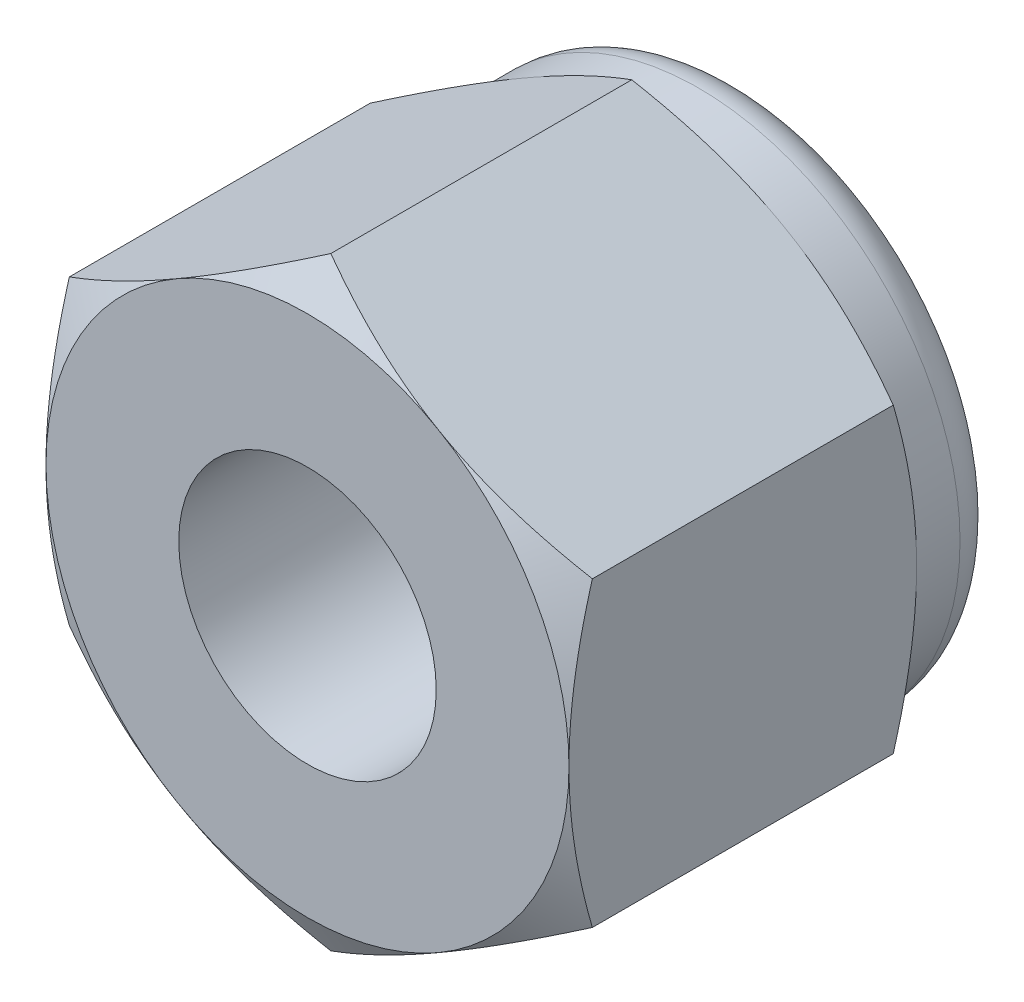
ISO-10303-21;
HEADER;
FILE_DESCRIPTION(('STEP AP214'),'2;1');
FILE_NAME('part.step','',(''),(''),'','','');
FILE_SCHEMA(('AUTOMOTIVE_DESIGN { 1 0 10303 214 1 1 1 1 }'));
ENDSEC;
DATA;
#1=APPLICATION_CONTEXT('core data for automotive mechanical design processes');
#2=APPLICATION_PROTOCOL_DEFINITION('international standard','automotive_design',2000,#1);
#3=PRODUCT_CONTEXT('',#1,'mechanical');
#4=PRODUCT('Part','Part','',(#3));
#5=PRODUCT_RELATED_PRODUCT_CATEGORY('part','',(#4));
#6=PRODUCT_DEFINITION_FORMATION('','',#4);
#7=PRODUCT_DEFINITION_CONTEXT('part definition',#1,'design');
#8=PRODUCT_DEFINITION('design','',#6,#7);
#9=PRODUCT_DEFINITION_SHAPE('','',#8);
#10=(LENGTH_UNIT() NAMED_UNIT(*) SI_UNIT(.MILLI.,.METRE.));
#11=(NAMED_UNIT(*) PLANE_ANGLE_UNIT() SI_UNIT($,.RADIAN.));
#12=(NAMED_UNIT(*) SI_UNIT($,.STERADIAN.) SOLID_ANGLE_UNIT());
#13=UNCERTAINTY_MEASURE_WITH_UNIT(LENGTH_MEASURE(1.E-05),#10,'distance_accuracy_value','');
#14=(GEOMETRIC_REPRESENTATION_CONTEXT(3) GLOBAL_UNCERTAINTY_ASSIGNED_CONTEXT((#13)) GLOBAL_UNIT_ASSIGNED_CONTEXT((#10,
#11,#12)) REPRESENTATION_CONTEXT('',''));
#15=CARTESIAN_POINT('',(0.,0.,0.));
#16=DIRECTION('',(0.,0.,1.));
#17=DIRECTION('',(1.,0.,0.));
#18=AXIS2_PLACEMENT_3D('',#15,#16,#17);
#19=CARTESIAN_POINT('',(-6.5,11.2583302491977,0.));
#20=DIRECTION('',(0.,0.,-1.));
#21=DIRECTION('',(-1.,0.,0.));
#22=AXIS2_PLACEMENT_3D('',#19,#20,#21);
#23=PLANE('',#22);
#24=CARTESIAN_POINT('',(0.,0.,0.));
#25=DIRECTION('',(0.,0.,-1.));
#26=DIRECTION('',(-1.,0.,0.));
#27=AXIS2_PLACEMENT_3D('',#24,#25,#26);
#28=CIRCLE('',#27,6.5);
#29=CARTESIAN_POINT('',(-6.5,0.,0.));
#30=VERTEX_POINT('',#29);
#31=CARTESIAN_POINT('',(-3.25,5.62916512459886,0.));
#32=VERTEX_POINT('',#31);
#33=EDGE_CURVE('E158',#30,#32,#28,.T.);
#34=ORIENTED_EDGE('',*,*,#33,.F.);
#35=CARTESIAN_POINT('',(0.,0.,0.));
#36=DIRECTION('',(0.,0.,-1.));
#37=DIRECTION('',(-1.,0.,0.));
#38=AXIS2_PLACEMENT_3D('',#35,#36,#37);
#39=CIRCLE('',#38,6.5);
#40=CARTESIAN_POINT('',(-3.25,-5.62916512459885,0.));
#41=VERTEX_POINT('',#40);
#42=EDGE_CURVE('E147',#30,#41,#39,.F.);
#43=ORIENTED_EDGE('',*,*,#42,.T.);
#44=CARTESIAN_POINT('',(3.25,-5.62916512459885,0.));
#45=VERTEX_POINT('',#44);
#46=EDGE_CURVE('E263',#41,#45,#39,.F.);
#47=ORIENTED_EDGE('',*,*,#46,.T.);
#48=CARTESIAN_POINT('',(6.5,0.,0.));
#49=VERTEX_POINT('',#48);
#50=EDGE_CURVE('E268',#45,#49,#39,.F.);
#51=ORIENTED_EDGE('',*,*,#50,.T.);
#52=CARTESIAN_POINT('',(3.25,5.62916512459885,0.));
#53=VERTEX_POINT('',#52);
#54=EDGE_CURVE('E269',#49,#53,#39,.F.);
#55=ORIENTED_EDGE('',*,*,#54,.T.);
#56=EDGE_CURVE('E250',#53,#32,#39,.F.);
#57=ORIENTED_EDGE('',*,*,#56,.T.);
#58=EDGE_LOOP('',(#34,#43,#47,#51,#55,#57));
#59=FACE_BOUND('',#58,.T.);
#60=CARTESIAN_POINT('',(0.,0.,0.));
#61=DIRECTION('',(0.,0.,1.));
#62=DIRECTION('',(1.,0.,0.));
#63=AXIS2_PLACEMENT_3D('',#60,#61,#62);
#64=CIRCLE('',#63,3.2);
#65=CARTESIAN_POINT('',(3.2,0.,0.));
#66=VERTEX_POINT('',#65);
#67=EDGE_CURVE('E547',#66,#66,#64,.T.);
#68=ORIENTED_EDGE('',*,*,#67,.F.);
#69=EDGE_LOOP('',(#68));
#70=FACE_BOUND('',#69,.T.);
#71=ADVANCED_FACE('F34',(#59,#70),#23,.F.);
#72=CARTESIAN_POINT('',(0.,0.,0.));
#73=DIRECTION('',(0.,0.,-1.));
#74=DIRECTION('',(-1.,0.,0.));
#75=AXIS2_PLACEMENT_3D('',#72,#73,#74);
#76=CONICAL_SURFACE('',#75,6.5,1.0471975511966);
#77=CARTESIAN_POINT('',(-6.5,-10.1736624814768,-3.21747930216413));
#78=CARTESIAN_POINT('',(-6.5,-9.88893123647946,-3.07898676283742));
#79=CARTESIAN_POINT('',(-6.5,-9.60355622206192,-2.94179558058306));
#80=CARTESIAN_POINT('',(-6.5,-9.03117658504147,-2.67074614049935));
#81=CARTESIAN_POINT('',(-6.5,-8.74417172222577,-2.53688839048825));
#82=CARTESIAN_POINT('',(-6.5,-8.16675630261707,-2.27258262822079));
#83=CARTESIAN_POINT('',(-6.5,-7.87633576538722,-2.14215634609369));
#84=CARTESIAN_POINT('',(-6.5,-7.29321673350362,-1.88651925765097));
#85=CARTESIAN_POINT('',(-6.5,-7.00051834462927,-1.76130821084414));
#86=CARTESIAN_POINT('',(-6.5,-6.40265737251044,-1.51344551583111));
#87=CARTESIAN_POINT('',(-6.5,-6.09740254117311,-1.39101519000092));
#88=CARTESIAN_POINT('',(-6.5,-5.48335613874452,-1.15519685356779));
#89=CARTESIAN_POINT('',(-6.5,-5.17456418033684,-1.04180984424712));
#90=CARTESIAN_POINT('',(-6.5,-4.55350146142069,-0.826985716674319));
#91=CARTESIAN_POINT('',(-6.5,-4.24123886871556,-0.725525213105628));
#92=CARTESIAN_POINT('',(-6.5,-3.61223214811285,-0.537748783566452));
#93=CARTESIAN_POINT('',(-6.5,-3.29548943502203,-0.451428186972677));
#94=CARTESIAN_POINT('',(-6.5,-2.6590943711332,-0.298462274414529));
#95=CARTESIAN_POINT('',(-6.5,-2.33946831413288,-0.23170929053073));
#96=CARTESIAN_POINT('',(-6.5,-1.69610066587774,-0.121613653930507));
#97=CARTESIAN_POINT('',(-6.5,-1.37235950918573,-0.0782685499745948));
#98=CARTESIAN_POINT('',(-6.5,-0.887107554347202,-0.0336806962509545));
#99=CARTESIAN_POINT('',(-6.5,-0.726495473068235,-0.0222331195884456));
#100=CARTESIAN_POINT('',(-6.5,-0.40492384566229,-0.00613908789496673));
#101=CARTESIAN_POINT('',(-6.5,-0.243964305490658,-0.00149251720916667));
#102=CARTESIAN_POINT('',(-6.5,0.0780064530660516,0.000880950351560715));
#103=CARTESIAN_POINT('',(-6.5,0.239017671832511,-0.00139220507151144));
#104=CARTESIAN_POINT('',(-6.5,0.56079926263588,-0.0127995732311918));
#105=CARTESIAN_POINT('',(-6.5,0.721569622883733,-0.0219341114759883));
#106=CARTESIAN_POINT('',(-6.5,1.10508667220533,-0.0517134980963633));
#107=CARTESIAN_POINT('',(-6.5,1.3275982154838,-0.0754547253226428));
#108=CARTESIAN_POINT('',(-6.5,1.7710207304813,-0.134807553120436));
#109=CARTESIAN_POINT('',(-6.5,1.99193149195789,-0.170420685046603));
#110=CARTESIAN_POINT('',(-6.5,2.65197510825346,-0.293183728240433));
#111=CARTESIAN_POINT('',(-6.5,3.08819198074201,-0.396237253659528));
#112=CARTESIAN_POINT('',(-6.5,3.74072142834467,-0.575626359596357));
#113=CARTESIAN_POINT('',(-6.5,3.96039794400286,-0.640434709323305));
#114=CARTESIAN_POINT('',(-6.5,4.39761828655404,-0.776949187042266));
#115=CARTESIAN_POINT('',(-6.5,4.61516209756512,-0.848655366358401));
#116=CARTESIAN_POINT('',(-6.5,5.04818448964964,-0.997801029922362));
#117=CARTESIAN_POINT('',(-6.5,5.26366366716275,-1.07523879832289));
#118=CARTESIAN_POINT('',(-6.5,5.69282335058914,-1.23491972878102));
#119=CARTESIAN_POINT('',(-6.5,5.90650389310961,-1.31716279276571));
#120=CARTESIAN_POINT('',(-6.5,6.46786430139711,-1.53931558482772));
#121=CARTESIAN_POINT('',(-6.5,6.81421040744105,-1.68259193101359));
#122=CARTESIAN_POINT('',(-6.5,7.50346506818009,-1.97721515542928));
#123=CARTESIAN_POINT('',(-6.5,7.84637327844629,-2.12856283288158));
#124=CARTESIAN_POINT('',(-6.5,8.5295140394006,-2.43747132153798));
#125=CARTESIAN_POINT('',(-6.5,8.86974561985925,-2.59503427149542));
#126=CARTESIAN_POINT('',(-6.5,9.54793719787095,-2.91492912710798));
#127=CARTESIAN_POINT('',(-6.5,9.8858972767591,-3.07726086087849));
#128=CARTESIAN_POINT('',(-6.5,10.5604862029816,-3.40592631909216));
#129=CARTESIAN_POINT('',(-6.5,10.8971123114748,-3.5722656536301));
#130=CARTESIAN_POINT('',(-6.5,11.5688621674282,-3.90795197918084));
#131=CARTESIAN_POINT('',(-6.5,11.9039859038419,-4.07729899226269));
#132=CARTESIAN_POINT('',(-6.5,12.5729258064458,-4.41838919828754));
#133=CARTESIAN_POINT('',(-6.5,12.9067422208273,-4.59013190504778));
#134=CARTESIAN_POINT('',(-6.5,13.5733435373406,-4.9356087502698));
#135=CARTESIAN_POINT('',(-6.5,13.9061284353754,-5.10934289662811));
#136=CARTESIAN_POINT('',(-6.5,14.8357351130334,-5.59757548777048));
#137=CARTESIAN_POINT('',(-6.5,15.4315971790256,-5.91390091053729));
#138=CARTESIAN_POINT('',(-6.5,16.621289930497,-6.55041933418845));
#139=CARTESIAN_POINT('',(-6.5,17.2151205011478,-6.87061254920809));
#140=CARTESIAN_POINT('',(-6.5,18.3993394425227,-7.51287045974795));
#141=CARTESIAN_POINT('',(-6.5,18.9897327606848,-7.83492604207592));
#142=CARTESIAN_POINT('',(-6.5,20.1692464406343,-8.48125879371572));
#143=CARTESIAN_POINT('',(-6.5,20.7583668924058,-8.80553579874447));
#144=CARTESIAN_POINT('',(-6.5,21.3470365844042,-9.13062304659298));
#145=B_SPLINE_CURVE_WITH_KNOTS('',3,(#77,#78,#79,#80,#81,#82,#83,#84,#85,#86,#87,#88,#89,#90,
#91,#92,#93,#94,#95,#96,#97,#98,#99,#100,#101,#102,#103,#104,#105,#106,#107,#108,#109,#110,#111,
#112,#113,#114,#115,#116,#117,#118,#119,#120,#121,#122,#123,#124,#125,#126,#127,#128,#129,#130,
#131,#132,#133,#134,#135,#136,#137,#138,#139,#140,#141,#142,#143,#144),.UNSPECIFIED.,.F.,.F.,(4,
2,2,2,2,2,2,2,2,2,2,2,2,2,2,2,2,2,2,2,2,2,2,2,2,2,2,2,2,2,2,2,2,4),(0.,0.949889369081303,
1.89992257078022,2.85497095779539,3.8099752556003,4.79653944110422,5.7832127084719,
6.7679178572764,7.75231869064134,8.73119670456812,9.70997219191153,10.1929086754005,
10.6758369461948,11.15876886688,11.6417236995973,12.3126703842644,12.983703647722,
14.3264516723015,15.0135023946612,15.7005582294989,16.3874092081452,17.0742461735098,
18.1985306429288,19.3229266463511,20.4477130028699,21.5724588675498,22.6988830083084,
23.8253154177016,24.951522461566,26.0777339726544,28.1015747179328,30.1255280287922,
32.1430846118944,34.1604935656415),.UNSPECIFIED.);
#146=CARTESIAN_POINT('',(-6.5,3.75277674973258,-0.580556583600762));
#147=VERTEX_POINT('',#146);
#148=EDGE_CURVE('E175',#147,#30,#145,.F.);
#149=ORIENTED_EDGE('',*,*,#148,.T.);
#150=ORIENTED_EDGE('',*,*,#33,.T.);
#151=CARTESIAN_POINT('',(0.000200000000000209,7.50566896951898,-0.580623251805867));
#152=CARTESIAN_POINT('',(-0.14267745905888,7.42317863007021,-0.533004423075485));
#153=CARTESIAN_POINT('',(-0.286087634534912,7.34038072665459,-0.487546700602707));
#154=CARTESIAN_POINT('',(-0.574072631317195,7.17411251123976,-0.401548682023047));
#155=CARTESIAN_POINT('',(-0.718647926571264,7.09064192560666,-0.361010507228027));
#156=CARTESIAN_POINT('',(-1.15468865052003,6.8388936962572,-0.247571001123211));
#157=CARTESIAN_POINT('',(-1.44787528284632,6.66962231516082,-0.183047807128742));
#158=CARTESIAN_POINT('',(-1.88662374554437,6.41631077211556,-0.107386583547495));
#159=CARTESIAN_POINT('',(-2.03087463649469,6.33302748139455,-0.085832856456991));
#160=CARTESIAN_POINT('',(-2.32002821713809,6.16608458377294,-0.0496903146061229));
#161=CARTESIAN_POINT('',(-2.46493084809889,6.08242501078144,-0.0351008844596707));
#162=CARTESIAN_POINT('',(-2.75498777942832,5.91496056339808,-0.0132587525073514));
#163=CARTESIAN_POINT('',(-2.90014160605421,5.83115596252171,-0.00599772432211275));
#164=CARTESIAN_POINT('',(-3.19057533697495,5.66347396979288,0.00103969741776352));
#165=CARTESIAN_POINT('',(-3.33585523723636,5.57959658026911,0.000816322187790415));
#166=CARTESIAN_POINT('',(-3.7338759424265,5.34979921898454,-0.0100834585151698));
#167=CARTESIAN_POINT('',(-3.98648646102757,5.20395446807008,-0.0283818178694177));
#168=CARTESIAN_POINT('',(-4.49002967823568,4.91323365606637,-0.0864063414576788));
#169=CARTESIAN_POINT('',(-4.74096060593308,4.76835861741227,-0.126152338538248));
#170=CARTESIAN_POINT('',(-5.24551722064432,4.47705272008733,-0.225505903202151));
#171=CARTESIAN_POINT('',(-5.49907924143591,4.33065861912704,-0.285534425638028));
#172=CARTESIAN_POINT('',(-6.00242193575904,4.04005357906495,-0.421774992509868));
#173=CARTESIAN_POINT('',(-6.25220905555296,3.89583891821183,-0.497955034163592));
#174=CARTESIAN_POINT('',(-6.5002,3.75266127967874,-0.580623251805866));
#175=B_SPLINE_CURVE_WITH_KNOTS('',3,(#151,#152,#153,#154,#155,#156,#157,#158,#159,#160,#161,
#162,#163,#164,#165,#166,#167,#168,#169,#170,#171,#172,#173,#174),.UNSPECIFIED.,.F.,.F.,(4,2,2,
2,2,2,2,2,2,2,2,4),(0.,0.515105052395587,1.03043143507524,2.06322554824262,2.56697389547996,
3.07067772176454,3.57380860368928,4.0769239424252,4.9527935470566,5.82947446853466,
6.72559912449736,7.61996451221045),.UNSPECIFIED.);
#176=EDGE_CURVE('E162',#32,#147,#175,.T.);
#177=ORIENTED_EDGE('',*,*,#176,.T.);
#178=EDGE_LOOP('',(#149,#150,#177));
#179=FACE_BOUND('',#178,.T.);
#180=ADVANCED_FACE('F182',(#179),#76,.T.);
#181=CARTESIAN_POINT('',(6.5002,3.75266127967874,-0.580623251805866));
#182=CARTESIAN_POINT('',(6.35732254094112,3.83515161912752,-0.533004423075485));
#183=CARTESIAN_POINT('',(6.21391236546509,3.91794952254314,-0.487546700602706));
#184=CARTESIAN_POINT('',(5.9259273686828,4.08421773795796,-0.401548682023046));
#185=CARTESIAN_POINT('',(5.78135207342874,4.16768832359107,-0.361010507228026));
#186=CARTESIAN_POINT('',(5.34531134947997,4.41943655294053,-0.24757100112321));
#187=CARTESIAN_POINT('',(5.05212471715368,4.58870793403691,-0.183047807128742));
#188=CARTESIAN_POINT('',(4.61337625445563,4.84201947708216,-0.107386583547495));
#189=CARTESIAN_POINT('',(4.46912536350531,4.92530276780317,-0.085832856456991));
#190=CARTESIAN_POINT('',(4.17997178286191,5.09224566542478,-0.049690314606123));
#191=CARTESIAN_POINT('',(4.03506915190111,5.17590523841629,-0.0351008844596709));
#192=CARTESIAN_POINT('',(3.74501222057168,5.34336968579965,-0.0132587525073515));
#193=CARTESIAN_POINT('',(3.59985839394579,5.42717428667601,-0.00599772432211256));
#194=CARTESIAN_POINT('',(3.30942466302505,5.59485627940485,0.00103969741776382));
#195=CARTESIAN_POINT('',(3.16414476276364,5.67873366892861,0.0008163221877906));
#196=CARTESIAN_POINT('',(2.7661240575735,5.90853103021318,-0.0100834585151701));
#197=CARTESIAN_POINT('',(2.51351353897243,6.05437578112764,-0.0283818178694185));
#198=CARTESIAN_POINT('',(2.00997032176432,6.34509659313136,-0.0864063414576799));
#199=CARTESIAN_POINT('',(1.75903939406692,6.48997163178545,-0.126152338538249));
#200=CARTESIAN_POINT('',(1.25448277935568,6.78127752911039,-0.225505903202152));
#201=CARTESIAN_POINT('',(1.00092075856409,6.92767163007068,-0.285534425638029));
#202=CARTESIAN_POINT('',(0.497578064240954,7.21827667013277,-0.42177499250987));
#203=CARTESIAN_POINT('',(0.247790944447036,7.3624913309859,-0.497955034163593));
#204=CARTESIAN_POINT('',(-0.000200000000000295,7.50566896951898,-0.580623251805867));
#205=B_SPLINE_CURVE_WITH_KNOTS('',3,(#181,#182,#183,#184,#185,#186,#187,#188,#189,#190,#191,
#192,#193,#194,#195,#196,#197,#198,#199,#200,#201,#202,#203,#204),.UNSPECIFIED.,.F.,.F.,(4,2,2,
2,2,2,2,2,2,2,2,4),(0.,0.515105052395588,1.03043143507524,2.06322554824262,2.56697389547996,
3.07067772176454,3.57380860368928,4.0769239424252,4.9527935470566,5.82947446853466,
6.72559912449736,7.61996451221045),.UNSPECIFIED.);
#206=CARTESIAN_POINT('',(0.,7.50555349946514,-0.580556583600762));
#207=VERTEX_POINT('',#206);
#208=EDGE_CURVE('E200',#53,#207,#205,.T.);
#209=ORIENTED_EDGE('',*,*,#208,.T.);
#210=EDGE_CURVE('E174',#207,#32,#175,.T.);
#211=ORIENTED_EDGE('',*,*,#210,.T.);
#212=ORIENTED_EDGE('',*,*,#56,.F.);
#213=EDGE_LOOP('',(#209,#211,#212));
#214=FACE_BOUND('',#213,.T.);
#215=ADVANCED_FACE('F187',(#214),#76,.T.);
#216=CARTESIAN_POINT('',(6.5,-10.1736624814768,-3.21747930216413));
#217=CARTESIAN_POINT('',(6.5,-9.88893123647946,-3.07898676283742));
#218=CARTESIAN_POINT('',(6.5,-9.60355622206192,-2.94179558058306));
#219=CARTESIAN_POINT('',(6.5,-9.03117658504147,-2.67074614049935));
#220=CARTESIAN_POINT('',(6.5,-8.74417172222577,-2.53688839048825));
#221=CARTESIAN_POINT('',(6.5,-8.16675630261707,-2.27258262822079));
#222=CARTESIAN_POINT('',(6.5,-7.87633576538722,-2.14215634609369));
#223=CARTESIAN_POINT('',(6.5,-7.29321673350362,-1.88651925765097));
#224=CARTESIAN_POINT('',(6.5,-7.00051834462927,-1.76130821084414));
#225=CARTESIAN_POINT('',(6.5,-6.40265737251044,-1.51344551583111));
#226=CARTESIAN_POINT('',(6.5,-6.09740254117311,-1.39101519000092));
#227=CARTESIAN_POINT('',(6.5,-5.48335613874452,-1.15519685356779));
#228=CARTESIAN_POINT('',(6.5,-5.17456418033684,-1.04180984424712));
#229=CARTESIAN_POINT('',(6.5,-4.55350146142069,-0.826985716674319));
#230=CARTESIAN_POINT('',(6.5,-4.24123886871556,-0.725525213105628));
#231=CARTESIAN_POINT('',(6.5,-3.61223214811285,-0.537748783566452));
#232=CARTESIAN_POINT('',(6.5,-3.29548943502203,-0.451428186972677));
#233=CARTESIAN_POINT('',(6.5,-2.6590943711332,-0.298462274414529));
#234=CARTESIAN_POINT('',(6.5,-2.33946831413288,-0.23170929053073));
#235=CARTESIAN_POINT('',(6.5,-1.69610066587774,-0.121613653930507));
#236=CARTESIAN_POINT('',(6.5,-1.37235950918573,-0.0782685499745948));
#237=CARTESIAN_POINT('',(6.5,-0.887107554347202,-0.0336806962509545));
#238=CARTESIAN_POINT('',(6.5,-0.726495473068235,-0.0222331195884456));
#239=CARTESIAN_POINT('',(6.5,-0.40492384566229,-0.00613908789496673));
#240=CARTESIAN_POINT('',(6.5,-0.243964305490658,-0.00149251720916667));
#241=CARTESIAN_POINT('',(6.5,0.0780064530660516,0.000880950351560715));
#242=CARTESIAN_POINT('',(6.5,0.239017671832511,-0.00139220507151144));
#243=CARTESIAN_POINT('',(6.5,0.56079926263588,-0.0127995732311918));
#244=CARTESIAN_POINT('',(6.5,0.721569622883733,-0.0219341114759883));
#245=CARTESIAN_POINT('',(6.5,1.10508667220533,-0.0517134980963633));
#246=CARTESIAN_POINT('',(6.5,1.3275982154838,-0.0754547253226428));
#247=CARTESIAN_POINT('',(6.5,1.7710207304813,-0.134807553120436));
#248=CARTESIAN_POINT('',(6.5,1.99193149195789,-0.170420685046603));
#249=CARTESIAN_POINT('',(6.5,2.65197510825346,-0.293183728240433));
#250=CARTESIAN_POINT('',(6.5,3.08819198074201,-0.396237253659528));
#251=CARTESIAN_POINT('',(6.5,3.74072142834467,-0.575626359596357));
#252=CARTESIAN_POINT('',(6.5,3.96039794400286,-0.640434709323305));
#253=CARTESIAN_POINT('',(6.5,4.39761828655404,-0.776949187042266));
#254=CARTESIAN_POINT('',(6.5,4.61516209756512,-0.848655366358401));
#255=CARTESIAN_POINT('',(6.5,5.04818448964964,-0.997801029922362));
#256=CARTESIAN_POINT('',(6.5,5.26366366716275,-1.07523879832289));
#257=CARTESIAN_POINT('',(6.5,5.69282335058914,-1.23491972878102));
#258=CARTESIAN_POINT('',(6.5,5.90650389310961,-1.31716279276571));
#259=CARTESIAN_POINT('',(6.5,6.46786430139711,-1.53931558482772));
#260=CARTESIAN_POINT('',(6.5,6.81421040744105,-1.68259193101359));
#261=CARTESIAN_POINT('',(6.5,7.50346506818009,-1.97721515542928));
#262=CARTESIAN_POINT('',(6.5,7.84637327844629,-2.12856283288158));
#263=CARTESIAN_POINT('',(6.5,8.5295140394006,-2.43747132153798));
#264=CARTESIAN_POINT('',(6.5,8.86974561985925,-2.59503427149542));
#265=CARTESIAN_POINT('',(6.5,9.54793719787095,-2.91492912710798));
#266=CARTESIAN_POINT('',(6.5,9.8858972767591,-3.07726086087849));
#267=CARTESIAN_POINT('',(6.5,10.5604862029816,-3.40592631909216));
#268=CARTESIAN_POINT('',(6.5,10.8971123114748,-3.5722656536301));
#269=CARTESIAN_POINT('',(6.5,11.5688621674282,-3.90795197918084));
#270=CARTESIAN_POINT('',(6.5,11.9039859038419,-4.07729899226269));
#271=CARTESIAN_POINT('',(6.5,12.5729258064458,-4.41838919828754));
#272=CARTESIAN_POINT('',(6.5,12.9067422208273,-4.59013190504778));
#273=CARTESIAN_POINT('',(6.5,13.5733435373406,-4.9356087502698));
#274=CARTESIAN_POINT('',(6.5,13.9061284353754,-5.10934289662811));
#275=CARTESIAN_POINT('',(6.5,14.8357351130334,-5.59757548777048));
#276=CARTESIAN_POINT('',(6.5,15.4315971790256,-5.91390091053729));
#277=CARTESIAN_POINT('',(6.5,16.621289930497,-6.55041933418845));
#278=CARTESIAN_POINT('',(6.5,17.2151205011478,-6.87061254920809));
#279=CARTESIAN_POINT('',(6.5,18.3993394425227,-7.51287045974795));
#280=CARTESIAN_POINT('',(6.5,18.9897327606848,-7.83492604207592));
#281=CARTESIAN_POINT('',(6.5,20.1692464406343,-8.48125879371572));
#282=CARTESIAN_POINT('',(6.5,20.7583668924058,-8.80553579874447));
#283=CARTESIAN_POINT('',(6.5,21.3470365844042,-9.13062304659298));
#284=B_SPLINE_CURVE_WITH_KNOTS('',3,(#216,#217,#218,#219,#220,#221,#222,#223,#224,#225,#226,
#227,#228,#229,#230,#231,#232,#233,#234,#235,#236,#237,#238,#239,#240,#241,#242,#243,#244,#245,
#246,#247,#248,#249,#250,#251,#252,#253,#254,#255,#256,#257,#258,#259,#260,#261,#262,#263,#264,
#265,#266,#267,#268,#269,#270,#271,#272,#273,#274,#275,#276,#277,#278,#279,#280,#281,#282,#283),
.UNSPECIFIED.,.F.,.F.,(4,2,2,2,2,2,2,2,2,2,2,2,2,2,2,2,2,2,2,2,2,2,2,2,2,2,2,2,2,2,2,2,2,4),(0.,
0.949889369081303,1.89992257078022,2.85497095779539,3.8099752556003,4.79653944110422,
5.7832127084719,6.7679178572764,7.75231869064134,8.73119670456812,9.70997219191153,
10.1929086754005,10.6758369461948,11.15876886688,11.6417236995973,12.3126703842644,
12.983703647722,14.3264516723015,15.0135023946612,15.7005582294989,16.3874092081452,
17.0742461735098,18.1985306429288,19.3229266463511,20.4477130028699,21.5724588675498,
22.6988830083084,23.8253154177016,24.951522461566,26.0777339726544,28.1015747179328,
30.1255280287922,32.1430846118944,34.1604935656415),.UNSPECIFIED.);
#285=CARTESIAN_POINT('',(6.5,3.75277674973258,-0.580556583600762));
#286=VERTEX_POINT('',#285);
#287=EDGE_CURVE('E211',#49,#286,#284,.T.);
#288=ORIENTED_EDGE('',*,*,#287,.T.);
#289=EDGE_CURVE('E288',#286,#53,#205,.T.);
#290=ORIENTED_EDGE('',*,*,#289,.T.);
#291=ORIENTED_EDGE('',*,*,#54,.F.);
#292=EDGE_LOOP('',(#288,#290,#291));
#293=FACE_BOUND('',#292,.T.);
#294=ADVANCED_FACE('F287',(#293),#76,.T.);
#295=CARTESIAN_POINT('',(-0.000200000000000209,-7.50566896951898,-0.580623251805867));
#296=CARTESIAN_POINT('',(0.14267745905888,-7.42317863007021,-0.533004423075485));
#297=CARTESIAN_POINT('',(0.286087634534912,-7.34038072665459,-0.487546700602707));
#298=CARTESIAN_POINT('',(0.574072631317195,-7.17411251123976,-0.401548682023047));
#299=CARTESIAN_POINT('',(0.718647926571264,-7.09064192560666,-0.361010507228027));
#300=CARTESIAN_POINT('',(1.15468865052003,-6.8388936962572,-0.247571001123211));
#301=CARTESIAN_POINT('',(1.44787528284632,-6.66962231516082,-0.183047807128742));
#302=CARTESIAN_POINT('',(1.88662374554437,-6.41631077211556,-0.107386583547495));
#303=CARTESIAN_POINT('',(2.03087463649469,-6.33302748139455,-0.085832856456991));
#304=CARTESIAN_POINT('',(2.32002821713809,-6.16608458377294,-0.0496903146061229));
#305=CARTESIAN_POINT('',(2.46493084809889,-6.08242501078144,-0.0351008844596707));
#306=CARTESIAN_POINT('',(2.75498777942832,-5.91496056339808,-0.0132587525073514));
#307=CARTESIAN_POINT('',(2.90014160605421,-5.83115596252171,-0.00599772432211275));
#308=CARTESIAN_POINT('',(3.19057533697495,-5.66347396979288,0.00103969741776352));
#309=CARTESIAN_POINT('',(3.33585523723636,-5.57959658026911,0.000816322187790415));
#310=CARTESIAN_POINT('',(3.7338759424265,-5.34979921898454,-0.0100834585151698));
#311=CARTESIAN_POINT('',(3.98648646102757,-5.20395446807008,-0.0283818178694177));
#312=CARTESIAN_POINT('',(4.49002967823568,-4.91323365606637,-0.0864063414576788));
#313=CARTESIAN_POINT('',(4.74096060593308,-4.76835861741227,-0.126152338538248));
#314=CARTESIAN_POINT('',(5.24551722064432,-4.47705272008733,-0.225505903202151));
#315=CARTESIAN_POINT('',(5.49907924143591,-4.33065861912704,-0.285534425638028));
#316=CARTESIAN_POINT('',(6.00242193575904,-4.04005357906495,-0.421774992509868));
#317=CARTESIAN_POINT('',(6.25220905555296,-3.89583891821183,-0.497955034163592));
#318=CARTESIAN_POINT('',(6.5002,-3.75266127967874,-0.580623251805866));
#319=B_SPLINE_CURVE_WITH_KNOTS('',3,(#295,#296,#297,#298,#299,#300,#301,#302,#303,#304,#305,
#306,#307,#308,#309,#310,#311,#312,#313,#314,#315,#316,#317,#318),.UNSPECIFIED.,.F.,.F.,(4,2,2,
2,2,2,2,2,2,2,2,4),(0.,0.515105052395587,1.03043143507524,2.06322554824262,2.56697389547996,
3.07067772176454,3.57380860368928,4.0769239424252,4.9527935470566,5.82947446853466,
6.72559912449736,7.61996451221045),.UNSPECIFIED.);
#320=CARTESIAN_POINT('',(6.5,-3.75277674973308,-0.580556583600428));
#321=VERTEX_POINT('',#320);
#322=EDGE_CURVE('E217',#45,#321,#319,.T.);
#323=ORIENTED_EDGE('',*,*,#322,.T.);
#324=EDGE_CURVE('E216',#321,#49,#284,.T.);
#325=ORIENTED_EDGE('',*,*,#324,.T.);
#326=ORIENTED_EDGE('',*,*,#50,.F.);
#327=EDGE_LOOP('',(#323,#325,#326));
#328=FACE_BOUND('',#327,.T.);
#329=ADVANCED_FACE('F311',(#328),#76,.T.);
#330=CARTESIAN_POINT('',(0.,-7.50555349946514,-0.580556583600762));
#331=VERTEX_POINT('',#330);
#332=EDGE_CURVE('E137',#331,#45,#319,.T.);
#333=ORIENTED_EDGE('',*,*,#332,.T.);
#334=ORIENTED_EDGE('',*,*,#46,.F.);
#335=CARTESIAN_POINT('',(-6.5002,-3.75266127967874,-0.580623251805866));
#336=CARTESIAN_POINT('',(-6.35732254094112,-3.83515161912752,-0.533004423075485));
#337=CARTESIAN_POINT('',(-6.21391236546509,-3.91794952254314,-0.487546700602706));
#338=CARTESIAN_POINT('',(-5.9259273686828,-4.08421773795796,-0.401548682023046));
#339=CARTESIAN_POINT('',(-5.78135207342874,-4.16768832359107,-0.361010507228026));
#340=CARTESIAN_POINT('',(-5.34531134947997,-4.41943655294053,-0.24757100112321));
#341=CARTESIAN_POINT('',(-5.05212471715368,-4.58870793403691,-0.183047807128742));
#342=CARTESIAN_POINT('',(-4.61337625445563,-4.84201947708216,-0.107386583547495));
#343=CARTESIAN_POINT('',(-4.46912536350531,-4.92530276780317,-0.085832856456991));
#344=CARTESIAN_POINT('',(-4.17997178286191,-5.09224566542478,-0.049690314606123));
#345=CARTESIAN_POINT('',(-4.03506915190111,-5.17590523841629,-0.0351008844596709));
#346=CARTESIAN_POINT('',(-3.74501222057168,-5.34336968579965,-0.0132587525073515));
#347=CARTESIAN_POINT('',(-3.59985839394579,-5.42717428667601,-0.00599772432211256));
#348=CARTESIAN_POINT('',(-3.30942466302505,-5.59485627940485,0.00103969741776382));
#349=CARTESIAN_POINT('',(-3.16414476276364,-5.67873366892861,0.0008163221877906));
#350=CARTESIAN_POINT('',(-2.7661240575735,-5.90853103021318,-0.0100834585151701));
#351=CARTESIAN_POINT('',(-2.51351353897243,-6.05437578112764,-0.0283818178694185));
#352=CARTESIAN_POINT('',(-2.00997032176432,-6.34509659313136,-0.0864063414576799));
#353=CARTESIAN_POINT('',(-1.75903939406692,-6.48997163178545,-0.126152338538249));
#354=CARTESIAN_POINT('',(-1.25448277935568,-6.78127752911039,-0.225505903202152));
#355=CARTESIAN_POINT('',(-1.00092075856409,-6.92767163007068,-0.285534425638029));
#356=CARTESIAN_POINT('',(-0.497578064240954,-7.21827667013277,-0.42177499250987));
#357=CARTESIAN_POINT('',(-0.247790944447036,-7.3624913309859,-0.497955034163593));
#358=CARTESIAN_POINT('',(0.000200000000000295,-7.50566896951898,-0.580623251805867));
#359=B_SPLINE_CURVE_WITH_KNOTS('',3,(#335,#336,#337,#338,#339,#340,#341,#342,#343,#344,#345,
#346,#347,#348,#349,#350,#351,#352,#353,#354,#355,#356,#357,#358),.UNSPECIFIED.,.F.,.F.,(4,2,2,
2,2,2,2,2,2,2,2,4),(0.,0.515105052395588,1.03043143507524,2.06322554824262,2.56697389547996,
3.07067772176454,3.57380860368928,4.0769239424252,4.9527935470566,5.82947446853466,
6.72559912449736,7.61996451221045),.UNSPECIFIED.);
#360=EDGE_CURVE('E308',#41,#331,#359,.T.);
#361=ORIENTED_EDGE('',*,*,#360,.T.);
#362=EDGE_LOOP('',(#333,#334,#361));
#363=FACE_BOUND('',#362,.T.);
#364=ADVANCED_FACE('F189',(#363),#76,.T.);
#365=CARTESIAN_POINT('',(-6.5,-3.75277674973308,-0.580556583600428));
#366=VERTEX_POINT('',#365);
#367=EDGE_CURVE('E205',#366,#41,#359,.T.);
#368=ORIENTED_EDGE('',*,*,#367,.T.);
#369=ORIENTED_EDGE('',*,*,#42,.F.);
#370=EDGE_CURVE('E291',#30,#366,#145,.F.);
#371=ORIENTED_EDGE('',*,*,#370,.T.);
#372=EDGE_LOOP('',(#368,#369,#371));
#373=FACE_BOUND('',#372,.T.);
#374=ADVANCED_FACE('F304',(#373),#76,.T.);
#375=CARTESIAN_POINT('',(6.5,3.75277674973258,-8.64));
#376=DIRECTION('',(0.499999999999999,0.866025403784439,0.));
#377=DIRECTION('',(-0.866025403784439,0.5,0.));
#378=AXIS2_PLACEMENT_3D('',#375,#376,#377);
#379=PLANE('',#378);
#380=CARTESIAN_POINT('',(-0.000200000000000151,7.50566896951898,-8.05937674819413));
#381=CARTESIAN_POINT('',(0.14267745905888,7.42317863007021,-8.10699557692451));
#382=CARTESIAN_POINT('',(0.286087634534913,7.34038072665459,-8.15245329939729));
#383=CARTESIAN_POINT('',(0.574072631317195,7.17411251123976,-8.23845131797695));
#384=CARTESIAN_POINT('',(0.718647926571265,7.09064192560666,-8.27898949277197));
#385=CARTESIAN_POINT('',(1.15468865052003,6.8388936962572,-8.39242899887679));
#386=CARTESIAN_POINT('',(1.44787528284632,6.66962231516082,-8.45695219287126));
#387=CARTESIAN_POINT('',(1.88662374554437,6.41631077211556,-8.5326134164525));
#388=CARTESIAN_POINT('',(2.03087463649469,6.33302748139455,-8.55416714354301));
#389=CARTESIAN_POINT('',(2.32002821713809,6.16608458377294,-8.59030968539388));
#390=CARTESIAN_POINT('',(2.46493084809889,6.08242501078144,-8.60489911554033));
#391=CARTESIAN_POINT('',(2.75498777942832,5.91496056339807,-8.62674124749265));
#392=CARTESIAN_POINT('',(2.90014160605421,5.83115596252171,-8.63400227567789));
#393=CARTESIAN_POINT('',(3.19057533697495,5.66347396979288,-8.64103969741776));
#394=CARTESIAN_POINT('',(3.33585523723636,5.57959658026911,-8.64081632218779));
#395=CARTESIAN_POINT('',(3.7338759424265,5.34979921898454,-8.62991654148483));
#396=CARTESIAN_POINT('',(3.98648646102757,5.20395446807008,-8.61161818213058));
#397=CARTESIAN_POINT('',(4.49002967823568,4.91323365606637,-8.55359365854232));
#398=CARTESIAN_POINT('',(4.74096060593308,4.76835861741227,-8.51384766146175));
#399=CARTESIAN_POINT('',(5.24551722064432,4.47705272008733,-8.41449409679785));
#400=CARTESIAN_POINT('',(5.49907924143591,4.33065861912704,-8.35446557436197));
#401=CARTESIAN_POINT('',(6.00242193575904,4.04005357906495,-8.21822500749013));
#402=CARTESIAN_POINT('',(6.25220905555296,3.89583891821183,-8.14204496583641));
#403=CARTESIAN_POINT('',(6.5002,3.75266127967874,-8.05937674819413));
#404=B_SPLINE_CURVE_WITH_KNOTS('',3,(#380,#381,#382,#383,#384,#385,#386,#387,#388,#389,#390,
#391,#392,#393,#394,#395,#396,#397,#398,#399,#400,#401,#402,#403),.UNSPECIFIED.,.F.,.F.,(4,2,2,
2,2,2,2,2,2,2,2,4),(0.,0.515105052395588,1.03043143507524,2.06322554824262,2.56697389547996,
3.07067772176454,3.57380860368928,4.0769239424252,4.9527935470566,5.82947446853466,
6.72559912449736,7.61996451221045),.UNSPECIFIED.);
#405=CARTESIAN_POINT('',(0.,7.50555349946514,-8.05944341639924));
#406=VERTEX_POINT('',#405);
#407=CARTESIAN_POINT('',(3.25,5.62916512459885,-8.64));
#408=VERTEX_POINT('',#407);
#409=EDGE_CURVE('E141',#406,#408,#404,.T.);
#410=ORIENTED_EDGE('',*,*,#409,.F.);
#411=DIRECTION('',(0.,0.,1.));
#412=VECTOR('',#411,1.);
#413=CARTESIAN_POINT('',(0.,7.50555349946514,-8.64));
#414=LINE('',#413,#412);
#415=EDGE_CURVE('E134',#406,#207,#414,.T.);
#416=ORIENTED_EDGE('',*,*,#415,.T.);
#417=ORIENTED_EDGE('',*,*,#208,.F.);
#418=ORIENTED_EDGE('',*,*,#289,.F.);
#419=DIRECTION('',(0.,0.,1.));
#420=VECTOR('',#419,1.);
#421=CARTESIAN_POINT('',(6.5,3.75277674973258,-8.64));
#422=LINE('',#421,#420);
#423=CARTESIAN_POINT('',(6.5,3.75277674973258,-8.05944341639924));
#424=VERTEX_POINT('',#423);
#425=EDGE_CURVE('E247',#424,#286,#422,.T.);
#426=ORIENTED_EDGE('',*,*,#425,.F.);
#427=EDGE_CURVE('E242',#408,#424,#404,.T.);
#428=ORIENTED_EDGE('',*,*,#427,.F.);
#429=EDGE_LOOP('',(#410,#416,#417,#418,#426,#428));
#430=FACE_BOUND('',#429,.T.);
#431=ADVANCED_FACE('F36',(#430),#379,.T.);
#432=CARTESIAN_POINT('',(6.5,-3.75277674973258,-8.64));
#433=DIRECTION('',(1.,0.,0.));
#434=DIRECTION('',(0.,0.,-1.));
#435=AXIS2_PLACEMENT_3D('',#432,#433,#434);
#436=PLANE('',#435);
#437=CARTESIAN_POINT('',(6.5,-10.1736624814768,-5.42252069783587));
#438=CARTESIAN_POINT('',(6.5,-9.88893123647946,-5.56101323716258));
#439=CARTESIAN_POINT('',(6.5,-9.60355622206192,-5.69820441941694));
#440=CARTESIAN_POINT('',(6.5,-9.03117658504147,-5.96925385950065));
#441=CARTESIAN_POINT('',(6.5,-8.74417172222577,-6.10311160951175));
#442=CARTESIAN_POINT('',(6.5,-8.16675630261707,-6.36741737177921));
#443=CARTESIAN_POINT('',(6.5,-7.87633576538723,-6.49784365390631));
#444=CARTESIAN_POINT('',(6.5,-7.29321673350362,-6.75348074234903));
#445=CARTESIAN_POINT('',(6.5,-7.00051834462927,-6.87869178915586));
#446=CARTESIAN_POINT('',(6.5,-6.40265737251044,-7.12655448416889));
#447=CARTESIAN_POINT('',(6.5,-6.09740254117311,-7.24898480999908));
#448=CARTESIAN_POINT('',(6.5,-5.48335613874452,-7.48480314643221));
#449=CARTESIAN_POINT('',(6.5,-5.17456418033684,-7.59819015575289));
#450=CARTESIAN_POINT('',(6.5,-4.55350146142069,-7.81301428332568));
#451=CARTESIAN_POINT('',(6.5,-4.24123886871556,-7.91447478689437));
#452=CARTESIAN_POINT('',(6.5,-3.61223214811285,-8.10225121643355));
#453=CARTESIAN_POINT('',(6.5,-3.29548943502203,-8.18857181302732));
#454=CARTESIAN_POINT('',(6.5,-2.6590943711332,-8.34153772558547));
#455=CARTESIAN_POINT('',(6.5,-2.33946831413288,-8.40829070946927));
#456=CARTESIAN_POINT('',(6.5,-1.69610066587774,-8.51838634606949));
#457=CARTESIAN_POINT('',(6.5,-1.37235950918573,-8.5617314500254));
#458=CARTESIAN_POINT('',(6.5,-0.887107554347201,-8.60631930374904));
#459=CARTESIAN_POINT('',(6.5,-0.726495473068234,-8.61776688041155));
#460=CARTESIAN_POINT('',(6.5,-0.404923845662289,-8.63386091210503));
#461=CARTESIAN_POINT('',(6.5,-0.243964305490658,-8.63850748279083));
#462=CARTESIAN_POINT('',(6.5,0.0780064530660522,-8.64088095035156));
#463=CARTESIAN_POINT('',(6.5,0.239017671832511,-8.63860779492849));
#464=CARTESIAN_POINT('',(6.5,0.56079926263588,-8.62720042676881));
#465=CARTESIAN_POINT('',(6.5,0.721569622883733,-8.61806588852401));
#466=CARTESIAN_POINT('',(6.5,1.10508667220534,-8.58828650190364));
#467=CARTESIAN_POINT('',(6.5,1.3275982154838,-8.56454527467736));
#468=CARTESIAN_POINT('',(6.5,1.7710207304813,-8.50519244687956));
#469=CARTESIAN_POINT('',(6.5,1.99193149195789,-8.4695793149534));
#470=CARTESIAN_POINT('',(6.5,2.65197510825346,-8.34681627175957));
#471=CARTESIAN_POINT('',(6.5,3.08819198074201,-8.24376274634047));
#472=CARTESIAN_POINT('',(6.5,3.74072142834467,-8.06437364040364));
#473=CARTESIAN_POINT('',(6.5,3.96039794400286,-7.99956529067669));
#474=CARTESIAN_POINT('',(6.5,4.39761828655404,-7.86305081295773));
#475=CARTESIAN_POINT('',(6.5,4.61516209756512,-7.7913446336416));
#476=CARTESIAN_POINT('',(6.5,5.04818448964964,-7.64219897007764));
#477=CARTESIAN_POINT('',(6.5,5.26366366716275,-7.56476120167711));
#478=CARTESIAN_POINT('',(6.5,5.69282335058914,-7.40508027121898));
#479=CARTESIAN_POINT('',(6.5,5.90650389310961,-7.32283720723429));
#480=CARTESIAN_POINT('',(6.5,6.46786430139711,-7.10068441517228));
#481=CARTESIAN_POINT('',(6.5,6.81421040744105,-6.95740806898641));
#482=CARTESIAN_POINT('',(6.5,7.50346506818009,-6.66278484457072));
#483=CARTESIAN_POINT('',(6.5,7.84637327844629,-6.51143716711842));
#484=CARTESIAN_POINT('',(6.5,8.5295140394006,-6.20252867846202));
#485=CARTESIAN_POINT('',(6.5,8.86974561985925,-6.04496572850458));
#486=CARTESIAN_POINT('',(6.5,9.54793719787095,-5.72507087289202));
#487=CARTESIAN_POINT('',(6.5,9.88589727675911,-5.56273913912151));
#488=CARTESIAN_POINT('',(6.5,10.5604862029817,-5.23407368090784));
#489=CARTESIAN_POINT('',(6.5,10.8971123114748,-5.0677343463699));
#490=CARTESIAN_POINT('',(6.5,11.5688621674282,-4.73204802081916));
#491=CARTESIAN_POINT('',(6.5,11.9039859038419,-4.56270100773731));
#492=CARTESIAN_POINT('',(6.5,12.5729258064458,-4.22161080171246));
#493=CARTESIAN_POINT('',(6.5,12.9067422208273,-4.04986809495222));
#494=CARTESIAN_POINT('',(6.5,13.5733435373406,-3.70439124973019));
#495=CARTESIAN_POINT('',(6.5,13.9061284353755,-3.53065710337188));
#496=CARTESIAN_POINT('',(6.5,14.8357351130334,-3.04242451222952));
#497=CARTESIAN_POINT('',(6.5,15.4315971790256,-2.72609908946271));
#498=CARTESIAN_POINT('',(6.5,16.621289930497,-2.08958066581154));
#499=CARTESIAN_POINT('',(6.5,17.2151205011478,-1.76938745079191));
#500=CARTESIAN_POINT('',(6.5,18.3993394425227,-1.12712954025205));
#501=CARTESIAN_POINT('',(6.5,18.9897327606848,-0.80507395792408));
#502=CARTESIAN_POINT('',(6.5,20.1692464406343,-0.158741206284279));
#503=CARTESIAN_POINT('',(6.5,20.7583668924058,0.165535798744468));
#504=CARTESIAN_POINT('',(6.5,21.3470365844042,0.490623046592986));
#505=B_SPLINE_CURVE_WITH_KNOTS('',3,(#437,#438,#439,#440,#441,#442,#443,#444,#445,#446,#447,
#448,#449,#450,#451,#452,#453,#454,#455,#456,#457,#458,#459,#460,#461,#462,#463,#464,#465,#466,
#467,#468,#469,#470,#471,#472,#473,#474,#475,#476,#477,#478,#479,#480,#481,#482,#483,#484,#485,
#486,#487,#488,#489,#490,#491,#492,#493,#494,#495,#496,#497,#498,#499,#500,#501,#502,#503,#504),
.UNSPECIFIED.,.F.,.F.,(4,2,2,2,2,2,2,2,2,2,2,2,2,2,2,2,2,2,2,2,2,2,2,2,2,2,2,2,2,2,2,2,2,4),(0.,
0.949889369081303,1.89992257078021,2.85497095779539,3.8099752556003,4.79653944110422,
5.7832127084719,6.7679178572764,7.75231869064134,8.73119670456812,9.70997219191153,
10.1929086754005,10.6758369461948,11.15876886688,11.6417236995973,12.3126703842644,
12.983703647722,14.3264516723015,15.0135023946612,15.7005582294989,16.3874092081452,
17.0742461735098,18.1985306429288,19.3229266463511,20.4477130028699,21.5724588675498,
22.6988830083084,23.8253154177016,24.951522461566,26.0777339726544,28.1015747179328,
30.1255280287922,32.1430846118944,34.1604935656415),.UNSPECIFIED.);
#506=CARTESIAN_POINT('',(6.5,0.,-8.64));
#507=VERTEX_POINT('',#506);
#508=EDGE_CURVE('E236',#424,#507,#505,.F.);
#509=ORIENTED_EDGE('',*,*,#508,.F.);
#510=ORIENTED_EDGE('',*,*,#425,.T.);
#511=ORIENTED_EDGE('',*,*,#287,.F.);
#512=ORIENTED_EDGE('',*,*,#324,.F.);
#513=DIRECTION('',(0.,0.,1.));
#514=VECTOR('',#513,1.);
#515=CARTESIAN_POINT('',(6.5,-3.75277674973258,-8.64));
#516=LINE('',#515,#514);
#517=CARTESIAN_POINT('',(6.5,-3.75277674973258,-8.05944341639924));
#518=VERTEX_POINT('',#517);
#519=EDGE_CURVE('E251',#518,#321,#516,.T.);
#520=ORIENTED_EDGE('',*,*,#519,.F.);
#521=EDGE_CURVE('E230',#507,#518,#505,.F.);
#522=ORIENTED_EDGE('',*,*,#521,.F.);
#523=EDGE_LOOP('',(#509,#510,#511,#512,#520,#522));
#524=FACE_BOUND('',#523,.T.);
#525=ADVANCED_FACE('F222',(#524),#436,.T.);
#526=CARTESIAN_POINT('',(6.5,-3.75277674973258,-8.64));
#527=DIRECTION('',(0.499999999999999,-0.866025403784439,0.));
#528=DIRECTION('',(0.866025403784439,0.5,0.));
#529=AXIS2_PLACEMENT_3D('',#526,#527,#528);
#530=PLANE('',#529);
#531=CARTESIAN_POINT('',(6.5002,-3.75266127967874,-8.05937674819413));
#532=CARTESIAN_POINT('',(6.35732254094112,-3.83515161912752,-8.10699557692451));
#533=CARTESIAN_POINT('',(6.21391236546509,-3.91794952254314,-8.15245329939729));
#534=CARTESIAN_POINT('',(5.9259273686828,-4.08421773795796,-8.23845131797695));
#535=CARTESIAN_POINT('',(5.78135207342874,-4.16768832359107,-8.27898949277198));
#536=CARTESIAN_POINT('',(5.34531134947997,-4.41943655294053,-8.39242899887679));
#537=CARTESIAN_POINT('',(5.05212471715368,-4.58870793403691,-8.45695219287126));
#538=CARTESIAN_POINT('',(4.61337625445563,-4.84201947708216,-8.5326134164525));
#539=CARTESIAN_POINT('',(4.46912536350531,-4.92530276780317,-8.55416714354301));
#540=CARTESIAN_POINT('',(4.17997178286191,-5.09224566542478,-8.59030968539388));
#541=CARTESIAN_POINT('',(4.03506915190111,-5.17590523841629,-8.60489911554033));
#542=CARTESIAN_POINT('',(3.74501222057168,-5.34336968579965,-8.62674124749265));
#543=CARTESIAN_POINT('',(3.59985839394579,-5.42717428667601,-8.63400227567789));
#544=CARTESIAN_POINT('',(3.30942466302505,-5.59485627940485,-8.64103969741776));
#545=CARTESIAN_POINT('',(3.16414476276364,-5.67873366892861,-8.64081632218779));
#546=CARTESIAN_POINT('',(2.76612405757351,-5.90853103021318,-8.62991654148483));
#547=CARTESIAN_POINT('',(2.51351353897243,-6.05437578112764,-8.61161818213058));
#548=CARTESIAN_POINT('',(2.00997032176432,-6.34509659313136,-8.55359365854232));
#549=CARTESIAN_POINT('',(1.75903939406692,-6.48997163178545,-8.51384766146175));
#550=CARTESIAN_POINT('',(1.25448277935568,-6.78127752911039,-8.41449409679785));
#551=CARTESIAN_POINT('',(1.00092075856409,-6.92767163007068,-8.35446557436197));
#552=CARTESIAN_POINT('',(0.497578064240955,-7.21827667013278,-8.21822500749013));
#553=CARTESIAN_POINT('',(0.247790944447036,-7.3624913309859,-8.1420449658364));
#554=CARTESIAN_POINT('',(-0.000200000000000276,-7.50566896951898,-8.05937674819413));
#555=B_SPLINE_CURVE_WITH_KNOTS('',3,(#531,#532,#533,#534,#535,#536,#537,#538,#539,#540,#541,
#542,#543,#544,#545,#546,#547,#548,#549,#550,#551,#552,#553,#554),.UNSPECIFIED.,.F.,.F.,(4,2,2,
2,2,2,2,2,2,2,2,4),(0.,0.515105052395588,1.03043143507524,2.06322554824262,2.56697389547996,
3.07067772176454,3.57380860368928,4.0769239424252,4.9527935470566,5.82947446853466,
6.72559912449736,7.61996451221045),.UNSPECIFIED.);
#556=CARTESIAN_POINT('',(3.25,-5.62916512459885,-8.64));
#557=VERTEX_POINT('',#556);
#558=EDGE_CURVE('E58',#518,#557,#555,.T.);
#559=ORIENTED_EDGE('',*,*,#558,.F.);
#560=ORIENTED_EDGE('',*,*,#519,.T.);
#561=ORIENTED_EDGE('',*,*,#322,.F.);
#562=ORIENTED_EDGE('',*,*,#332,.F.);
#563=DIRECTION('',(0.,0.,1.));
#564=VECTOR('',#563,1.);
#565=CARTESIAN_POINT('',(0.,-7.50555349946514,-8.64));
#566=LINE('',#565,#564);
#567=CARTESIAN_POINT('',(0.,-7.50555349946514,-8.05944341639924));
#568=VERTEX_POINT('',#567);
#569=EDGE_CURVE('E254',#568,#331,#566,.T.);
#570=ORIENTED_EDGE('',*,*,#569,.F.);
#571=EDGE_CURVE('E237',#557,#568,#555,.T.);
#572=ORIENTED_EDGE('',*,*,#571,.F.);
#573=EDGE_LOOP('',(#559,#560,#561,#562,#570,#572));
#574=FACE_BOUND('',#573,.T.);
#575=ADVANCED_FACE('F225',(#574),#530,.T.);
#576=CARTESIAN_POINT('',(-6.5,-3.75277674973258,-8.64));
#577=DIRECTION('',(-0.499999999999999,-0.866025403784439,0.));
#578=DIRECTION('',(0.866025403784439,-0.5,0.));
#579=AXIS2_PLACEMENT_3D('',#576,#577,#578);
#580=PLANE('',#579);
#581=CARTESIAN_POINT('',(0.000200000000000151,-7.50566896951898,-8.05937674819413));
#582=CARTESIAN_POINT('',(-0.14267745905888,-7.42317863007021,-8.10699557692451));
#583=CARTESIAN_POINT('',(-0.286087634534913,-7.34038072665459,-8.15245329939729));
#584=CARTESIAN_POINT('',(-0.574072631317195,-7.17411251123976,-8.23845131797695));
#585=CARTESIAN_POINT('',(-0.718647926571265,-7.09064192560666,-8.27898949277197));
#586=CARTESIAN_POINT('',(-1.15468865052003,-6.8388936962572,-8.39242899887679));
#587=CARTESIAN_POINT('',(-1.44787528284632,-6.66962231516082,-8.45695219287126));
#588=CARTESIAN_POINT('',(-1.88662374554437,-6.41631077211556,-8.5326134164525));
#589=CARTESIAN_POINT('',(-2.03087463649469,-6.33302748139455,-8.55416714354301));
#590=CARTESIAN_POINT('',(-2.32002821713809,-6.16608458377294,-8.59030968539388));
#591=CARTESIAN_POINT('',(-2.46493084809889,-6.08242501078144,-8.60489911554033));
#592=CARTESIAN_POINT('',(-2.75498777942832,-5.91496056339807,-8.62674124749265));
#593=CARTESIAN_POINT('',(-2.90014160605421,-5.83115596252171,-8.63400227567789));
#594=CARTESIAN_POINT('',(-3.19057533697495,-5.66347396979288,-8.64103969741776));
#595=CARTESIAN_POINT('',(-3.33585523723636,-5.57959658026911,-8.64081632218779));
#596=CARTESIAN_POINT('',(-3.7338759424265,-5.34979921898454,-8.62991654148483));
#597=CARTESIAN_POINT('',(-3.98648646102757,-5.20395446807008,-8.61161818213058));
#598=CARTESIAN_POINT('',(-4.49002967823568,-4.91323365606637,-8.55359365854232));
#599=CARTESIAN_POINT('',(-4.74096060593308,-4.76835861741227,-8.51384766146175));
#600=CARTESIAN_POINT('',(-5.24551722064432,-4.47705272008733,-8.41449409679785));
#601=CARTESIAN_POINT('',(-5.49907924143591,-4.33065861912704,-8.35446557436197));
#602=CARTESIAN_POINT('',(-6.00242193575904,-4.04005357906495,-8.21822500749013));
#603=CARTESIAN_POINT('',(-6.25220905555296,-3.89583891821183,-8.14204496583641));
#604=CARTESIAN_POINT('',(-6.5002,-3.75266127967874,-8.05937674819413));
#605=B_SPLINE_CURVE_WITH_KNOTS('',3,(#581,#582,#583,#584,#585,#586,#587,#588,#589,#590,#591,
#592,#593,#594,#595,#596,#597,#598,#599,#600,#601,#602,#603,#604),.UNSPECIFIED.,.F.,.F.,(4,2,2,
2,2,2,2,2,2,2,2,4),(0.,0.515105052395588,1.03043143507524,2.06322554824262,2.56697389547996,
3.07067772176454,3.57380860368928,4.0769239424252,4.9527935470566,5.82947446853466,
6.72559912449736,7.61996451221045),.UNSPECIFIED.);
#606=CARTESIAN_POINT('',(-3.25,-5.62916512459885,-8.64));
#607=VERTEX_POINT('',#606);
#608=EDGE_CURVE('E51',#568,#607,#605,.T.);
#609=ORIENTED_EDGE('',*,*,#608,.F.);
#610=ORIENTED_EDGE('',*,*,#569,.T.);
#611=ORIENTED_EDGE('',*,*,#360,.F.);
#612=ORIENTED_EDGE('',*,*,#367,.F.);
#613=DIRECTION('',(0.,0.,1.));
#614=VECTOR('',#613,1.);
#615=CARTESIAN_POINT('',(-6.5,-3.75277674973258,-8.64));
#616=LINE('',#615,#614);
#617=CARTESIAN_POINT('',(-6.5,-3.75277674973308,-8.05944341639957));
#618=VERTEX_POINT('',#617);
#619=EDGE_CURVE('E257',#618,#366,#616,.T.);
#620=ORIENTED_EDGE('',*,*,#619,.F.);
#621=EDGE_CURVE('E320',#607,#618,#605,.T.);
#622=ORIENTED_EDGE('',*,*,#621,.F.);
#623=EDGE_LOOP('',(#609,#610,#611,#612,#620,#622));
#624=FACE_BOUND('',#623,.T.);
#625=ADVANCED_FACE('F306',(#624),#580,.T.);
#626=CARTESIAN_POINT('',(-6.5,-3.75277674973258,-8.64));
#627=DIRECTION('',(-1.,0.,0.));
#628=DIRECTION('',(0.,0.,1.));
#629=AXIS2_PLACEMENT_3D('',#626,#627,#628);
#630=PLANE('',#629);
#631=CARTESIAN_POINT('',(-6.5,-10.1736624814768,-5.42252069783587));
#632=CARTESIAN_POINT('',(-6.5,-9.88893123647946,-5.56101323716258));
#633=CARTESIAN_POINT('',(-6.5,-9.60355622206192,-5.69820441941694));
#634=CARTESIAN_POINT('',(-6.5,-9.03117658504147,-5.96925385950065));
#635=CARTESIAN_POINT('',(-6.5,-8.74417172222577,-6.10311160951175));
#636=CARTESIAN_POINT('',(-6.5,-8.16675630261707,-6.36741737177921));
#637=CARTESIAN_POINT('',(-6.5,-7.87633576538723,-6.49784365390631));
#638=CARTESIAN_POINT('',(-6.5,-7.29321673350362,-6.75348074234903));
#639=CARTESIAN_POINT('',(-6.5,-7.00051834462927,-6.87869178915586));
#640=CARTESIAN_POINT('',(-6.5,-6.40265737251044,-7.12655448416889));
#641=CARTESIAN_POINT('',(-6.5,-6.09740254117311,-7.24898480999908));
#642=CARTESIAN_POINT('',(-6.5,-5.48335613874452,-7.48480314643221));
#643=CARTESIAN_POINT('',(-6.5,-5.17456418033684,-7.59819015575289));
#644=CARTESIAN_POINT('',(-6.5,-4.55350146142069,-7.81301428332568));
#645=CARTESIAN_POINT('',(-6.5,-4.24123886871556,-7.91447478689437));
#646=CARTESIAN_POINT('',(-6.5,-3.61223214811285,-8.10225121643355));
#647=CARTESIAN_POINT('',(-6.5,-3.29548943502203,-8.18857181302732));
#648=CARTESIAN_POINT('',(-6.5,-2.6590943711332,-8.34153772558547));
#649=CARTESIAN_POINT('',(-6.5,-2.33946831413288,-8.40829070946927));
#650=CARTESIAN_POINT('',(-6.5,-1.69610066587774,-8.51838634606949));
#651=CARTESIAN_POINT('',(-6.5,-1.37235950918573,-8.5617314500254));
#652=CARTESIAN_POINT('',(-6.5,-0.887107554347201,-8.60631930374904));
#653=CARTESIAN_POINT('',(-6.5,-0.726495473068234,-8.61776688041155));
#654=CARTESIAN_POINT('',(-6.5,-0.404923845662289,-8.63386091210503));
#655=CARTESIAN_POINT('',(-6.5,-0.243964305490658,-8.63850748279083));
#656=CARTESIAN_POINT('',(-6.5,0.0780064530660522,-8.64088095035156));
#657=CARTESIAN_POINT('',(-6.5,0.239017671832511,-8.63860779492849));
#658=CARTESIAN_POINT('',(-6.5,0.56079926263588,-8.62720042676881));
#659=CARTESIAN_POINT('',(-6.5,0.721569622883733,-8.61806588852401));
#660=CARTESIAN_POINT('',(-6.5,1.10508667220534,-8.58828650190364));
#661=CARTESIAN_POINT('',(-6.5,1.3275982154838,-8.56454527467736));
#662=CARTESIAN_POINT('',(-6.5,1.7710207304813,-8.50519244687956));
#663=CARTESIAN_POINT('',(-6.5,1.99193149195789,-8.4695793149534));
#664=CARTESIAN_POINT('',(-6.5,2.65197510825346,-8.34681627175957));
#665=CARTESIAN_POINT('',(-6.5,3.08819198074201,-8.24376274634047));
#666=CARTESIAN_POINT('',(-6.5,3.74072142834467,-8.06437364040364));
#667=CARTESIAN_POINT('',(-6.5,3.96039794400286,-7.99956529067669));
#668=CARTESIAN_POINT('',(-6.5,4.39761828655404,-7.86305081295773));
#669=CARTESIAN_POINT('',(-6.5,4.61516209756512,-7.7913446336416));
#670=CARTESIAN_POINT('',(-6.5,5.04818448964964,-7.64219897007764));
#671=CARTESIAN_POINT('',(-6.5,5.26366366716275,-7.56476120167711));
#672=CARTESIAN_POINT('',(-6.5,5.69282335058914,-7.40508027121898));
#673=CARTESIAN_POINT('',(-6.5,5.90650389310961,-7.32283720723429));
#674=CARTESIAN_POINT('',(-6.5,6.46786430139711,-7.10068441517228));
#675=CARTESIAN_POINT('',(-6.5,6.81421040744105,-6.95740806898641));
#676=CARTESIAN_POINT('',(-6.5,7.50346506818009,-6.66278484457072));
#677=CARTESIAN_POINT('',(-6.5,7.84637327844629,-6.51143716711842));
#678=CARTESIAN_POINT('',(-6.5,8.5295140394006,-6.20252867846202));
#679=CARTESIAN_POINT('',(-6.5,8.86974561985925,-6.04496572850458));
#680=CARTESIAN_POINT('',(-6.5,9.54793719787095,-5.72507087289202));
#681=CARTESIAN_POINT('',(-6.5,9.88589727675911,-5.56273913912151));
#682=CARTESIAN_POINT('',(-6.5,10.5604862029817,-5.23407368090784));
#683=CARTESIAN_POINT('',(-6.5,10.8971123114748,-5.0677343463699));
#684=CARTESIAN_POINT('',(-6.5,11.5688621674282,-4.73204802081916));
#685=CARTESIAN_POINT('',(-6.5,11.9039859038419,-4.56270100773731));
#686=CARTESIAN_POINT('',(-6.5,12.5729258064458,-4.22161080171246));
#687=CARTESIAN_POINT('',(-6.5,12.9067422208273,-4.04986809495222));
#688=CARTESIAN_POINT('',(-6.5,13.5733435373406,-3.70439124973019));
#689=CARTESIAN_POINT('',(-6.5,13.9061284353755,-3.53065710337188));
#690=CARTESIAN_POINT('',(-6.5,14.8357351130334,-3.04242451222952));
#691=CARTESIAN_POINT('',(-6.5,15.4315971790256,-2.72609908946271));
#692=CARTESIAN_POINT('',(-6.5,16.621289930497,-2.08958066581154));
#693=CARTESIAN_POINT('',(-6.5,17.2151205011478,-1.76938745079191));
#694=CARTESIAN_POINT('',(-6.5,18.3993394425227,-1.12712954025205));
#695=CARTESIAN_POINT('',(-6.5,18.9897327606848,-0.80507395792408));
#696=CARTESIAN_POINT('',(-6.5,20.1692464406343,-0.158741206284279));
#697=CARTESIAN_POINT('',(-6.5,20.7583668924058,0.165535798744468));
#698=CARTESIAN_POINT('',(-6.5,21.3470365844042,0.490623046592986));
#699=B_SPLINE_CURVE_WITH_KNOTS('',3,(#631,#632,#633,#634,#635,#636,#637,#638,#639,#640,#641,
#642,#643,#644,#645,#646,#647,#648,#649,#650,#651,#652,#653,#654,#655,#656,#657,#658,#659,#660,
#661,#662,#663,#664,#665,#666,#667,#668,#669,#670,#671,#672,#673,#674,#675,#676,#677,#678,#679,
#680,#681,#682,#683,#684,#685,#686,#687,#688,#689,#690,#691,#692,#693,#694,#695,#696,#697,#698),
.UNSPECIFIED.,.F.,.F.,(4,2,2,2,2,2,2,2,2,2,2,2,2,2,2,2,2,2,2,2,2,2,2,2,2,2,2,2,2,2,2,2,2,4),(0.,
0.949889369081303,1.89992257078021,2.85497095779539,3.8099752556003,4.79653944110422,
5.7832127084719,6.7679178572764,7.75231869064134,8.73119670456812,9.70997219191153,
10.1929086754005,10.6758369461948,11.15876886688,11.6417236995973,12.3126703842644,
12.983703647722,14.3264516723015,15.0135023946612,15.7005582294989,16.3874092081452,
17.0742461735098,18.1985306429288,19.3229266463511,20.4477130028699,21.5724588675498,
22.6988830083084,23.8253154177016,24.951522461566,26.0777339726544,28.1015747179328,
30.1255280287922,32.1430846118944,34.1604935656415),.UNSPECIFIED.);
#700=CARTESIAN_POINT('',(-6.5,0.,-8.64));
#701=VERTEX_POINT('',#700);
#702=EDGE_CURVE('E321',#618,#701,#699,.T.);
#703=ORIENTED_EDGE('',*,*,#702,.F.);
#704=ORIENTED_EDGE('',*,*,#619,.T.);
#705=ORIENTED_EDGE('',*,*,#370,.F.);
#706=ORIENTED_EDGE('',*,*,#148,.F.);
#707=DIRECTION('',(0.,0.,1.));
#708=VECTOR('',#707,1.);
#709=CARTESIAN_POINT('',(-6.5,3.75277674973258,-8.64));
#710=LINE('',#709,#708);
#711=CARTESIAN_POINT('',(-6.5,3.75277674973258,-8.05944341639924));
#712=VERTEX_POINT('',#711);
#713=EDGE_CURVE('E260',#712,#147,#710,.T.);
#714=ORIENTED_EDGE('',*,*,#713,.F.);
#715=EDGE_CURVE('E153',#701,#712,#699,.T.);
#716=ORIENTED_EDGE('',*,*,#715,.F.);
#717=EDGE_LOOP('',(#703,#704,#705,#706,#714,#716));
#718=FACE_BOUND('',#717,.T.);
#719=ADVANCED_FACE('F300',(#718),#630,.T.);
#720=CARTESIAN_POINT('',(-6.5,3.75277674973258,-8.64));
#721=DIRECTION('',(-0.499999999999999,0.866025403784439,0.));
#722=DIRECTION('',(-0.866025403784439,-0.5,0.));
#723=AXIS2_PLACEMENT_3D('',#720,#721,#722);
#724=PLANE('',#723);
#725=CARTESIAN_POINT('',(-6.5002,3.75266127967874,-8.05937674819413));
#726=CARTESIAN_POINT('',(-6.35732254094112,3.83515161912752,-8.10699557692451));
#727=CARTESIAN_POINT('',(-6.21391236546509,3.91794952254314,-8.15245329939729));
#728=CARTESIAN_POINT('',(-5.9259273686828,4.08421773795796,-8.23845131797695));
#729=CARTESIAN_POINT('',(-5.78135207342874,4.16768832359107,-8.27898949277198));
#730=CARTESIAN_POINT('',(-5.34531134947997,4.41943655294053,-8.39242899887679));
#731=CARTESIAN_POINT('',(-5.05212471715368,4.58870793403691,-8.45695219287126));
#732=CARTESIAN_POINT('',(-4.61337625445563,4.84201947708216,-8.5326134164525));
#733=CARTESIAN_POINT('',(-4.46912536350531,4.92530276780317,-8.55416714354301));
#734=CARTESIAN_POINT('',(-4.17997178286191,5.09224566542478,-8.59030968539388));
#735=CARTESIAN_POINT('',(-4.03506915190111,5.17590523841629,-8.60489911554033));
#736=CARTESIAN_POINT('',(-3.74501222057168,5.34336968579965,-8.62674124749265));
#737=CARTESIAN_POINT('',(-3.59985839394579,5.42717428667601,-8.63400227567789));
#738=CARTESIAN_POINT('',(-3.30942466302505,5.59485627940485,-8.64103969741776));
#739=CARTESIAN_POINT('',(-3.16414476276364,5.67873366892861,-8.64081632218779));
#740=CARTESIAN_POINT('',(-2.76612405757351,5.90853103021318,-8.62991654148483));
#741=CARTESIAN_POINT('',(-2.51351353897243,6.05437578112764,-8.61161818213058));
#742=CARTESIAN_POINT('',(-2.00997032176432,6.34509659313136,-8.55359365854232));
#743=CARTESIAN_POINT('',(-1.75903939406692,6.48997163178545,-8.51384766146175));
#744=CARTESIAN_POINT('',(-1.25448277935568,6.78127752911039,-8.41449409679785));
#745=CARTESIAN_POINT('',(-1.00092075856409,6.92767163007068,-8.35446557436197));
#746=CARTESIAN_POINT('',(-0.497578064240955,7.21827667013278,-8.21822500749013));
#747=CARTESIAN_POINT('',(-0.247790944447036,7.3624913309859,-8.1420449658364));
#748=CARTESIAN_POINT('',(0.000200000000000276,7.50566896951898,-8.05937674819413));
#749=B_SPLINE_CURVE_WITH_KNOTS('',3,(#725,#726,#727,#728,#729,#730,#731,#732,#733,#734,#735,
#736,#737,#738,#739,#740,#741,#742,#743,#744,#745,#746,#747,#748),.UNSPECIFIED.,.F.,.F.,(4,2,2,
2,2,2,2,2,2,2,2,4),(0.,0.515105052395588,1.03043143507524,2.06322554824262,2.56697389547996,
3.07067772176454,3.57380860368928,4.0769239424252,4.9527935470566,5.82947446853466,
6.72559912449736,7.61996451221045),.UNSPECIFIED.);
#750=CARTESIAN_POINT('',(-3.25,5.62916512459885,-8.64));
#751=VERTEX_POINT('',#750);
#752=EDGE_CURVE('E130',#712,#751,#749,.T.);
#753=ORIENTED_EDGE('',*,*,#752,.F.);
#754=ORIENTED_EDGE('',*,*,#713,.T.);
#755=ORIENTED_EDGE('',*,*,#176,.F.);
#756=ORIENTED_EDGE('',*,*,#210,.F.);
#757=ORIENTED_EDGE('',*,*,#415,.F.);
#758=EDGE_CURVE('E125',#751,#406,#749,.T.);
#759=ORIENTED_EDGE('',*,*,#758,.F.);
#760=EDGE_LOOP('',(#753,#754,#755,#756,#757,#759));
#761=FACE_BOUND('',#760,.T.);
#762=ADVANCED_FACE('F127',(#761),#724,.T.);
#763=CARTESIAN_POINT('',(0.,0.,-4.32));
#764=DIRECTION('',(0.,0.,1.));
#765=DIRECTION('',(1.,0.,0.));
#766=AXIS2_PLACEMENT_3D('',#763,#764,#765);
#767=CONICAL_SURFACE('',#766,13.9824594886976,1.0471975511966);
#768=ORIENTED_EDGE('',*,*,#715,.T.);
#769=ORIENTED_EDGE('',*,*,#752,.T.);
#770=CARTESIAN_POINT('',(0.,0.,-8.64));
#771=DIRECTION('',(0.,0.,-1.));
#772=DIRECTION('',(-1.,0.,0.));
#773=AXIS2_PLACEMENT_3D('',#770,#771,#772);
#774=CIRCLE('',#773,6.5);
#775=EDGE_CURVE('E151',#701,#751,#774,.T.);
#776=ORIENTED_EDGE('',*,*,#775,.F.);
#777=EDGE_LOOP('',(#768,#769,#776));
#778=FACE_BOUND('',#777,.T.);
#779=ADVANCED_FACE('F150',(#778),#767,.T.);
#780=ORIENTED_EDGE('',*,*,#409,.T.);
#781=CARTESIAN_POINT('',(0.,0.,-8.64));
#782=DIRECTION('',(0.,0.,-1.));
#783=DIRECTION('',(-1.,0.,0.));
#784=AXIS2_PLACEMENT_3D('',#781,#782,#783);
#785=CIRCLE('',#784,6.5);
#786=EDGE_CURVE('E44',#408,#751,#785,.F.);
#787=ORIENTED_EDGE('',*,*,#786,.T.);
#788=ORIENTED_EDGE('',*,*,#758,.T.);
#789=EDGE_LOOP('',(#780,#787,#788));
#790=FACE_BOUND('',#789,.T.);
#791=ADVANCED_FACE('F140',(#790),#767,.T.);
#792=ORIENTED_EDGE('',*,*,#427,.T.);
#793=ORIENTED_EDGE('',*,*,#508,.T.);
#794=EDGE_CURVE('E146',#507,#408,#785,.F.);
#795=ORIENTED_EDGE('',*,*,#794,.T.);
#796=EDGE_LOOP('',(#792,#793,#795));
#797=FACE_BOUND('',#796,.T.);
#798=ADVANCED_FACE('F413',(#797),#767,.T.);
#799=ORIENTED_EDGE('',*,*,#521,.T.);
#800=ORIENTED_EDGE('',*,*,#558,.T.);
#801=EDGE_CURVE('E317',#557,#507,#785,.F.);
#802=ORIENTED_EDGE('',*,*,#801,.T.);
#803=EDGE_LOOP('',(#799,#800,#802));
#804=FACE_BOUND('',#803,.T.);
#805=ADVANCED_FACE('F421',(#804),#767,.T.);
#806=ORIENTED_EDGE('',*,*,#571,.T.);
#807=ORIENTED_EDGE('',*,*,#608,.T.);
#808=EDGE_CURVE('E43',#607,#557,#785,.F.);
#809=ORIENTED_EDGE('',*,*,#808,.T.);
#810=EDGE_LOOP('',(#806,#807,#809));
#811=FACE_BOUND('',#810,.T.);
#812=ADVANCED_FACE('F319',(#811),#767,.T.);
#813=ORIENTED_EDGE('',*,*,#621,.T.);
#814=ORIENTED_EDGE('',*,*,#702,.T.);
#815=EDGE_CURVE('E11',#701,#607,#785,.F.);
#816=ORIENTED_EDGE('',*,*,#815,.T.);
#817=EDGE_LOOP('',(#813,#814,#816));
#818=FACE_BOUND('',#817,.T.);
#819=ADVANCED_FACE('F405',(#818),#767,.T.);
#820=CARTESIAN_POINT('',(0.,0.,0.));
#821=DIRECTION('',(0.,0.,1.));
#822=DIRECTION('',(1.,0.,0.));
#823=AXIS2_PLACEMENT_3D('',#820,#821,#822);
#824=CYLINDRICAL_SURFACE('',#823,3.75277674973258);
#825=CARTESIAN_POINT('',(0.,0.,-9.9));
#826=DIRECTION('',(0.,0.,1.));
#827=DIRECTION('',(1.,0.,0.));
#828=AXIS2_PLACEMENT_3D('',#825,#826,#827);
#829=CIRCLE('',#828,3.75277674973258);
#830=CARTESIAN_POINT('',(3.75277674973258,0.,-9.9));
#831=VERTEX_POINT('',#830);
#832=EDGE_CURVE('E159',#831,#831,#829,.T.);
#833=ORIENTED_EDGE('',*,*,#832,.F.);
#834=EDGE_LOOP('',(#833));
#835=FACE_BOUND('',#834,.T.);
#836=CARTESIAN_POINT('',(0.,0.,-8.64));
#837=DIRECTION('',(0.,0.,-1.));
#838=DIRECTION('',(-1.,0.,0.));
#839=AXIS2_PLACEMENT_3D('',#836,#837,#838);
#840=CIRCLE('',#839,3.75277674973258);
#841=CARTESIAN_POINT('',(-3.75277674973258,0.,-8.64));
#842=VERTEX_POINT('',#841);
#843=EDGE_CURVE('E551',#842,#842,#840,.F.);
#844=ORIENTED_EDGE('',*,*,#843,.T.);
#845=EDGE_LOOP('',(#844));
#846=FACE_BOUND('',#845,.T.);
#847=ADVANCED_FACE('F190',(#835,#846),#824,.F.);
#848=CARTESIAN_POINT('',(0.,5.12638837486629,-9.9));
#849=DIRECTION('',(0.,0.,1.));
#850=DIRECTION('',(1.,0.,0.));
#851=AXIS2_PLACEMENT_3D('',#848,#849,#850);
#852=PLANE('',#851);
#853=CARTESIAN_POINT('',(0.,0.,-9.9));
#854=DIRECTION('',(0.,0.,1.));
#855=DIRECTION('',(1.,0.,0.));
#856=AXIS2_PLACEMENT_3D('',#853,#854,#855);
#857=CIRCLE('',#856,5.12638837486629);
#858=CARTESIAN_POINT('',(5.12638837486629,0.,-9.9));
#859=VERTEX_POINT('',#858);
#860=EDGE_CURVE('E165',#859,#859,#857,.T.);
#861=ORIENTED_EDGE('',*,*,#860,.F.);
#862=EDGE_LOOP('',(#861));
#863=FACE_BOUND('',#862,.T.);
#864=ORIENTED_EDGE('',*,*,#832,.T.);
#865=EDGE_LOOP('',(#864));
#866=FACE_BOUND('',#865,.T.);
#867=ADVANCED_FACE('F452',(#863,#866),#852,.F.);
#868=CARTESIAN_POINT('',(0.,0.,0.));
#869=DIRECTION('',(0.,0.,1.));
#870=DIRECTION('',(1.,0.,0.));
#871=AXIS2_PLACEMENT_3D('',#868,#869,#870);
#872=CYLINDRICAL_SURFACE('',#871,5.12638837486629);
#873=CARTESIAN_POINT('',(0.,0.,-10.8));
#874=DIRECTION('',(0.,0.,1.));
#875=DIRECTION('',(1.,0.,0.));
#876=AXIS2_PLACEMENT_3D('',#873,#874,#875);
#877=CIRCLE('',#876,5.12638837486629);
#878=CARTESIAN_POINT('',(5.12638837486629,0.,-10.8));
#879=VERTEX_POINT('',#878);
#880=EDGE_CURVE('E563',#879,#879,#877,.T.);
#881=ORIENTED_EDGE('',*,*,#880,.F.);
#882=EDGE_LOOP('',(#881));
#883=FACE_BOUND('',#882,.T.);
#884=ORIENTED_EDGE('',*,*,#860,.T.);
#885=EDGE_LOOP('',(#884));
#886=FACE_BOUND('',#885,.T.);
#887=ADVANCED_FACE('F463',(#883,#886),#872,.F.);
#888=CARTESIAN_POINT('',(0.,5.42,-10.8));
#889=DIRECTION('',(0.,0.,1.));
#890=DIRECTION('',(1.,0.,0.));
#891=AXIS2_PLACEMENT_3D('',#888,#889,#890);
#892=PLANE('',#891);
#893=CARTESIAN_POINT('',(0.,0.,-10.8));
#894=DIRECTION('',(0.,0.,1.));
#895=DIRECTION('',(1.,0.,0.));
#896=AXIS2_PLACEMENT_3D('',#893,#894,#895);
#897=CIRCLE('',#896,5.42);
#898=CARTESIAN_POINT('',(5.42,0.,-10.8));
#899=VERTEX_POINT('',#898);
#900=EDGE_CURVE('E560',#899,#899,#897,.T.);
#901=ORIENTED_EDGE('',*,*,#900,.F.);
#902=EDGE_LOOP('',(#901));
#903=FACE_BOUND('',#902,.T.);
#904=ORIENTED_EDGE('',*,*,#880,.T.);
#905=EDGE_LOOP('',(#904));
#906=FACE_BOUND('',#905,.T.);
#907=ADVANCED_FACE('F472',(#903,#906),#892,.F.);
#908=CARTESIAN_POINT('',(0.,0.,-9.72));
#909=DIRECTION('',(0.,0.,1.));
#910=DIRECTION('',(1.,0.,0.));
#911=AXIS2_PLACEMENT_3D('',#908,#909,#910);
#912=TOROIDAL_SURFACE('',#911,5.42,1.08);
#913=CARTESIAN_POINT('',(0.,0.,-9.72));
#914=DIRECTION('',(0.,0.,1.));
#915=DIRECTION('',(1.,0.,0.));
#916=AXIS2_PLACEMENT_3D('',#913,#914,#915);
#917=CIRCLE('',#916,6.5);
#918=CARTESIAN_POINT('',(6.5,0.,-9.72));
#919=VERTEX_POINT('',#918);
#920=EDGE_CURVE('E554',#919,#919,#917,.T.);
#921=ORIENTED_EDGE('',*,*,#920,.F.);
#922=EDGE_LOOP('',(#921));
#923=FACE_BOUND('',#922,.T.);
#924=ORIENTED_EDGE('',*,*,#900,.T.);
#925=EDGE_LOOP('',(#924));
#926=FACE_BOUND('',#925,.T.);
#927=ADVANCED_FACE('F482',(#923,#926),#912,.T.);
#928=CARTESIAN_POINT('',(0.,0.,0.));
#929=DIRECTION('',(0.,0.,1.));
#930=DIRECTION('',(1.,0.,0.));
#931=AXIS2_PLACEMENT_3D('',#928,#929,#930);
#932=CYLINDRICAL_SURFACE('',#931,6.5);
#933=ORIENTED_EDGE('',*,*,#794,.F.);
#934=ORIENTED_EDGE('',*,*,#801,.F.);
#935=ORIENTED_EDGE('',*,*,#808,.F.);
#936=ORIENTED_EDGE('',*,*,#815,.F.);
#937=ORIENTED_EDGE('',*,*,#775,.T.);
#938=ORIENTED_EDGE('',*,*,#786,.F.);
#939=EDGE_LOOP('',(#933,#934,#935,#936,#937,#938));
#940=FACE_BOUND('',#939,.T.);
#941=ORIENTED_EDGE('',*,*,#920,.T.);
#942=EDGE_LOOP('',(#941));
#943=FACE_BOUND('',#942,.T.);
#944=ADVANCED_FACE('F155',(#940,#943),#932,.T.);
#945=CARTESIAN_POINT('',(0.,3.75277674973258,-8.64));
#946=DIRECTION('',(0.,0.,-1.));
#947=DIRECTION('',(-1.,0.,0.));
#948=AXIS2_PLACEMENT_3D('',#945,#946,#947);
#949=PLANE('',#948);
#950=CARTESIAN_POINT('',(0.,0.,-8.64));
#951=DIRECTION('',(0.,0.,-1.));
#952=DIRECTION('',(-1.,0.,0.));
#953=AXIS2_PLACEMENT_3D('',#950,#951,#952);
#954=CIRCLE('',#953,3.2);
#955=CARTESIAN_POINT('',(-3.2,0.,-8.64));
#956=VERTEX_POINT('',#955);
#957=EDGE_CURVE('E550',#956,#956,#954,.F.);
#958=ORIENTED_EDGE('',*,*,#957,.T.);
#959=EDGE_LOOP('',(#958));
#960=FACE_BOUND('',#959,.T.);
#961=ORIENTED_EDGE('',*,*,#843,.F.);
#962=EDGE_LOOP('',(#961));
#963=FACE_BOUND('',#962,.T.);
#964=ADVANCED_FACE('F499',(#960,#963),#949,.T.);
#965=CARTESIAN_POINT('',(0.,0.,-19.9537084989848));
#966=DIRECTION('',(0.,0.,1.));
#967=DIRECTION('',(1.,0.,0.));
#968=AXIS2_PLACEMENT_3D('',#965,#966,#967);
#969=CYLINDRICAL_SURFACE('',#968,3.2);
#970=ORIENTED_EDGE('',*,*,#67,.T.);
#971=EDGE_LOOP('',(#970));
#972=FACE_BOUND('',#971,.T.);
#973=ORIENTED_EDGE('',*,*,#957,.F.);
#974=EDGE_LOOP('',(#973));
#975=FACE_BOUND('',#974,.T.);
#976=ADVANCED_FACE('F507',(#972,#975),#969,.F.);
#977=CLOSED_SHELL('',(#71,#180,#215,#294,#329,#364,#374,#431,#525,#575,#625,#719,#762,#779,#791,
#798,#805,#812,#819,#847,#867,#887,#907,#927,#944,#964,#976));
#978=MANIFOLD_SOLID_BREP('B2',#977);
#979=ADVANCED_BREP_SHAPE_REPRESENTATION('',(#18,#978),#14);
#980=SHAPE_DEFINITION_REPRESENTATION(#9,#979);
ENDSEC;
END-ISO-10303-21;
